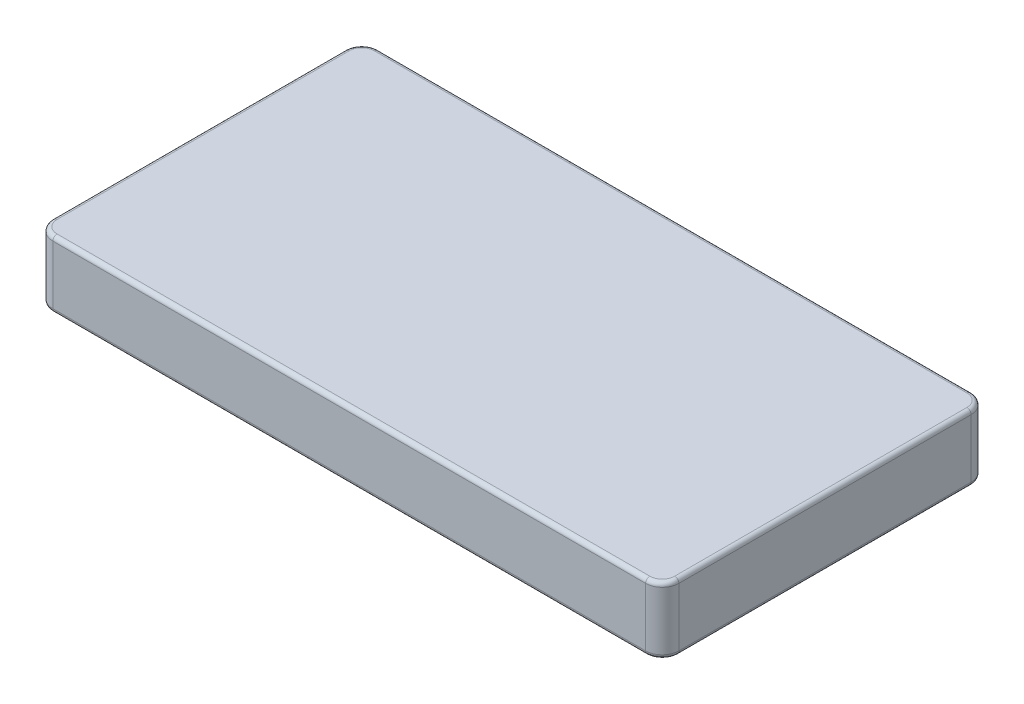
ISO-10303-21;
HEADER;
FILE_DESCRIPTION(('STEP AP214'),'2;1');
FILE_NAME('part.step','',(''),(''),'','','');
FILE_SCHEMA(('AUTOMOTIVE_DESIGN { 1 0 10303 214 1 1 1 1 }'));
ENDSEC;
DATA;
#1=APPLICATION_CONTEXT('core data for automotive mechanical design processes');
#2=APPLICATION_PROTOCOL_DEFINITION('international standard','automotive_design',2000,#1);
#3=PRODUCT_CONTEXT('',#1,'mechanical');
#4=PRODUCT('Part','Part','',(#3));
#5=PRODUCT_RELATED_PRODUCT_CATEGORY('part','',(#4));
#6=PRODUCT_DEFINITION_FORMATION('','',#4);
#7=PRODUCT_DEFINITION_CONTEXT('part definition',#1,'design');
#8=PRODUCT_DEFINITION('design','',#6,#7);
#9=PRODUCT_DEFINITION_SHAPE('','',#8);
#10=(LENGTH_UNIT() NAMED_UNIT(*) SI_UNIT(.MILLI.,.METRE.));
#11=(NAMED_UNIT(*) PLANE_ANGLE_UNIT() SI_UNIT($,.RADIAN.));
#12=(NAMED_UNIT(*) SI_UNIT($,.STERADIAN.) SOLID_ANGLE_UNIT());
#13=UNCERTAINTY_MEASURE_WITH_UNIT(LENGTH_MEASURE(1.E-05),#10,'distance_accuracy_value','');
#14=(GEOMETRIC_REPRESENTATION_CONTEXT(3) GLOBAL_UNCERTAINTY_ASSIGNED_CONTEXT((#13)) GLOBAL_UNIT_ASSIGNED_CONTEXT((#10,
#11,#12)) REPRESENTATION_CONTEXT('',''));
#15=CARTESIAN_POINT('',(0.,0.,0.));
#16=DIRECTION('',(0.,0.,1.));
#17=DIRECTION('',(1.,0.,0.));
#18=AXIS2_PLACEMENT_3D('',#15,#16,#17);
#19=CARTESIAN_POINT('',(901.7,203.2,-444.5));
#20=DIRECTION('',(0.,-1.,0.));
#21=DIRECTION('',(0.,0.,-1.));
#22=AXIS2_PLACEMENT_3D('',#19,#20,#21);
#23=CYLINDRICAL_SURFACE('',#22,50.8);
#24=DIRECTION('',(0.,-1.,0.));
#25=VECTOR('',#24,1.);
#26=CARTESIAN_POINT('',(952.5,203.2,-444.5));
#27=LINE('',#26,#25);
#28=CARTESIAN_POINT('',(952.5,190.5,-444.5));
#29=VERTEX_POINT('',#28);
#30=CARTESIAN_POINT('',(952.5,12.7,-444.5));
#31=VERTEX_POINT('',#30);
#32=EDGE_CURVE('E154',#29,#31,#27,.T.);
#33=ORIENTED_EDGE('',*,*,#32,.T.);
#34=CARTESIAN_POINT('',(901.7,12.7,-444.5));
#35=DIRECTION('',(0.,-1.,0.));
#36=DIRECTION('',(0.,0.,-1.));
#37=AXIS2_PLACEMENT_3D('',#34,#35,#36);
#38=CIRCLE('',#37,50.8);
#39=CARTESIAN_POINT('',(901.699999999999,12.7,-495.3));
#40=VERTEX_POINT('',#39);
#41=EDGE_CURVE('E277',#31,#40,#38,.F.);
#42=ORIENTED_EDGE('',*,*,#41,.T.);
#43=DIRECTION('',(0.,-1.,0.));
#44=VECTOR('',#43,1.);
#45=CARTESIAN_POINT('',(901.699999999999,203.2,-495.3));
#46=LINE('',#45,#44);
#47=CARTESIAN_POINT('',(901.699999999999,190.5,-495.3));
#48=VERTEX_POINT('',#47);
#49=EDGE_CURVE('E176',#48,#40,#46,.T.);
#50=ORIENTED_EDGE('',*,*,#49,.F.);
#51=CARTESIAN_POINT('',(901.7,190.5,-444.5));
#52=DIRECTION('',(0.,-1.,0.));
#53=DIRECTION('',(0.,0.,-1.));
#54=AXIS2_PLACEMENT_3D('',#51,#52,#53);
#55=CIRCLE('',#54,50.8);
#56=EDGE_CURVE('E275',#48,#29,#55,.T.);
#57=ORIENTED_EDGE('',*,*,#56,.T.);
#58=EDGE_LOOP('',(#33,#42,#50,#57));
#59=FACE_BOUND('',#58,.T.);
#60=ADVANCED_FACE('F33',(#59),#23,.T.);
#61=CARTESIAN_POINT('',(-901.7,203.2,-495.3));
#62=DIRECTION('',(0.,0.,1.));
#63=DIRECTION('',(1.,0.,0.));
#64=AXIS2_PLACEMENT_3D('',#61,#62,#63);
#65=PLANE('',#64);
#66=ORIENTED_EDGE('',*,*,#49,.T.);
#67=DIRECTION('',(-1.,0.,0.));
#68=VECTOR('',#67,1.);
#69=CARTESIAN_POINT('',(-901.7,12.7,-495.3));
#70=LINE('',#69,#68);
#71=CARTESIAN_POINT('',(-901.7,12.7,-495.3));
#72=VERTEX_POINT('',#71);
#73=EDGE_CURVE('E281',#40,#72,#70,.T.);
#74=ORIENTED_EDGE('',*,*,#73,.T.);
#75=DIRECTION('',(0.,-1.,0.));
#76=VECTOR('',#75,1.);
#77=CARTESIAN_POINT('',(-901.7,203.2,-495.3));
#78=LINE('',#77,#76);
#79=CARTESIAN_POINT('',(-901.7,190.5,-495.3));
#80=VERTEX_POINT('',#79);
#81=EDGE_CURVE('E252',#80,#72,#78,.T.);
#82=ORIENTED_EDGE('',*,*,#81,.F.);
#83=DIRECTION('',(-1.,0.,0.));
#84=VECTOR('',#83,1.);
#85=CARTESIAN_POINT('',(-901.7,190.5,-495.3));
#86=LINE('',#85,#84);
#87=EDGE_CURVE('E279',#80,#48,#86,.F.);
#88=ORIENTED_EDGE('',*,*,#87,.T.);
#89=EDGE_LOOP('',(#66,#74,#82,#88));
#90=FACE_BOUND('',#89,.T.);
#91=ADVANCED_FACE('F319',(#90),#65,.F.);
#92=CARTESIAN_POINT('',(-901.7,203.2,-444.5));
#93=DIRECTION('',(0.,-1.,0.));
#94=DIRECTION('',(0.,0.,-1.));
#95=AXIS2_PLACEMENT_3D('',#92,#93,#94);
#96=CYLINDRICAL_SURFACE('',#95,50.8);
#97=ORIENTED_EDGE('',*,*,#81,.T.);
#98=CARTESIAN_POINT('',(-901.7,12.7,-444.5));
#99=DIRECTION('',(0.,-1.,0.));
#100=DIRECTION('',(0.,0.,-1.));
#101=AXIS2_PLACEMENT_3D('',#98,#99,#100);
#102=CIRCLE('',#101,50.8);
#103=CARTESIAN_POINT('',(-952.5,12.7,-444.5));
#104=VERTEX_POINT('',#103);
#105=EDGE_CURVE('E285',#72,#104,#102,.F.);
#106=ORIENTED_EDGE('',*,*,#105,.T.);
#107=DIRECTION('',(0.,-1.,0.));
#108=VECTOR('',#107,1.);
#109=CARTESIAN_POINT('',(-952.5,203.2,-444.5));
#110=LINE('',#109,#108);
#111=CARTESIAN_POINT('',(-952.5,190.5,-444.5));
#112=VERTEX_POINT('',#111);
#113=EDGE_CURVE('E249',#112,#104,#110,.T.);
#114=ORIENTED_EDGE('',*,*,#113,.F.);
#115=CARTESIAN_POINT('',(-901.7,190.5,-444.5));
#116=DIRECTION('',(0.,-1.,0.));
#117=DIRECTION('',(0.,0.,-1.));
#118=AXIS2_PLACEMENT_3D('',#115,#116,#117);
#119=CIRCLE('',#118,50.8);
#120=EDGE_CURVE('E283',#112,#80,#119,.T.);
#121=ORIENTED_EDGE('',*,*,#120,.T.);
#122=EDGE_LOOP('',(#97,#106,#114,#121));
#123=FACE_BOUND('',#122,.T.);
#124=ADVANCED_FACE('F336',(#123),#96,.T.);
#125=CARTESIAN_POINT('',(-952.5,203.2,444.5));
#126=DIRECTION('',(1.,0.,0.));
#127=DIRECTION('',(0.,0.,-1.));
#128=AXIS2_PLACEMENT_3D('',#125,#126,#127);
#129=PLANE('',#128);
#130=ORIENTED_EDGE('',*,*,#113,.T.);
#131=DIRECTION('',(0.,0.,1.));
#132=VECTOR('',#131,1.);
#133=CARTESIAN_POINT('',(-952.5,12.7,444.5));
#134=LINE('',#133,#132);
#135=CARTESIAN_POINT('',(-952.5,12.7,444.5));
#136=VERTEX_POINT('',#135);
#137=EDGE_CURVE('E289',#104,#136,#134,.T.);
#138=ORIENTED_EDGE('',*,*,#137,.T.);
#139=DIRECTION('',(0.,-1.,0.));
#140=VECTOR('',#139,1.);
#141=CARTESIAN_POINT('',(-952.5,203.2,444.5));
#142=LINE('',#141,#140);
#143=CARTESIAN_POINT('',(-952.5,190.5,444.5));
#144=VERTEX_POINT('',#143);
#145=EDGE_CURVE('E246',#144,#136,#142,.T.);
#146=ORIENTED_EDGE('',*,*,#145,.F.);
#147=DIRECTION('',(0.,0.,1.));
#148=VECTOR('',#147,1.);
#149=CARTESIAN_POINT('',(-952.5,190.5,444.5));
#150=LINE('',#149,#148);
#151=EDGE_CURVE('E287',#144,#112,#150,.F.);
#152=ORIENTED_EDGE('',*,*,#151,.T.);
#153=EDGE_LOOP('',(#130,#138,#146,#152));
#154=FACE_BOUND('',#153,.T.);
#155=ADVANCED_FACE('F339',(#154),#129,.F.);
#156=CARTESIAN_POINT('',(-901.7,203.2,444.5));
#157=DIRECTION('',(0.,-1.,0.));
#158=DIRECTION('',(0.,0.,-1.));
#159=AXIS2_PLACEMENT_3D('',#156,#157,#158);
#160=CYLINDRICAL_SURFACE('',#159,50.8);
#161=ORIENTED_EDGE('',*,*,#145,.T.);
#162=CARTESIAN_POINT('',(-901.7,12.7,444.5));
#163=DIRECTION('',(0.,-1.,0.));
#164=DIRECTION('',(0.,0.,-1.));
#165=AXIS2_PLACEMENT_3D('',#162,#163,#164);
#166=CIRCLE('',#165,50.8);
#167=CARTESIAN_POINT('',(-901.7,12.7,495.3));
#168=VERTEX_POINT('',#167);
#169=EDGE_CURVE('E293',#136,#168,#166,.F.);
#170=ORIENTED_EDGE('',*,*,#169,.T.);
#171=DIRECTION('',(0.,-1.,0.));
#172=VECTOR('',#171,1.);
#173=CARTESIAN_POINT('',(-901.7,203.2,495.3));
#174=LINE('',#173,#172);
#175=CARTESIAN_POINT('',(-901.7,190.5,495.3));
#176=VERTEX_POINT('',#175);
#177=EDGE_CURVE('E243',#176,#168,#174,.T.);
#178=ORIENTED_EDGE('',*,*,#177,.F.);
#179=CARTESIAN_POINT('',(-901.7,190.5,444.5));
#180=DIRECTION('',(0.,-1.,0.));
#181=DIRECTION('',(0.,0.,-1.));
#182=AXIS2_PLACEMENT_3D('',#179,#180,#181);
#183=CIRCLE('',#182,50.8);
#184=EDGE_CURVE('E291',#176,#144,#183,.T.);
#185=ORIENTED_EDGE('',*,*,#184,.T.);
#186=EDGE_LOOP('',(#161,#170,#178,#185));
#187=FACE_BOUND('',#186,.T.);
#188=ADVANCED_FACE('F520',(#187),#160,.T.);
#189=CARTESIAN_POINT('',(-901.7,203.2,495.3));
#190=DIRECTION('',(0.,0.,-1.));
#191=DIRECTION('',(-1.,0.,0.));
#192=AXIS2_PLACEMENT_3D('',#189,#190,#191);
#193=PLANE('',#192);
#194=ORIENTED_EDGE('',*,*,#177,.T.);
#195=DIRECTION('',(1.,0.,0.));
#196=VECTOR('',#195,1.);
#197=CARTESIAN_POINT('',(901.699999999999,12.7,495.3));
#198=LINE('',#197,#196);
#199=CARTESIAN_POINT('',(901.699999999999,12.7,495.3));
#200=VERTEX_POINT('',#199);
#201=EDGE_CURVE('E297',#168,#200,#198,.T.);
#202=ORIENTED_EDGE('',*,*,#201,.T.);
#203=DIRECTION('',(0.,-1.,0.));
#204=VECTOR('',#203,1.);
#205=CARTESIAN_POINT('',(901.699999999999,203.2,495.3));
#206=LINE('',#205,#204);
#207=CARTESIAN_POINT('',(901.699999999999,190.5,495.3));
#208=VERTEX_POINT('',#207);
#209=EDGE_CURVE('E170',#208,#200,#206,.T.);
#210=ORIENTED_EDGE('',*,*,#209,.F.);
#211=DIRECTION('',(1.,0.,0.));
#212=VECTOR('',#211,1.);
#213=CARTESIAN_POINT('',(-901.7,190.5,495.3));
#214=LINE('',#213,#212);
#215=EDGE_CURVE('E295',#208,#176,#214,.F.);
#216=ORIENTED_EDGE('',*,*,#215,.T.);
#217=EDGE_LOOP('',(#194,#202,#210,#216));
#218=FACE_BOUND('',#217,.T.);
#219=ADVANCED_FACE('F512',(#218),#193,.F.);
#220=CARTESIAN_POINT('',(901.7,203.2,444.5));
#221=DIRECTION('',(0.,-1.,0.));
#222=DIRECTION('',(0.,0.,-1.));
#223=AXIS2_PLACEMENT_3D('',#220,#221,#222);
#224=CYLINDRICAL_SURFACE('',#223,50.8);
#225=ORIENTED_EDGE('',*,*,#209,.T.);
#226=CARTESIAN_POINT('',(901.7,12.7,444.5));
#227=DIRECTION('',(0.,-1.,0.));
#228=DIRECTION('',(0.,0.,-1.));
#229=AXIS2_PLACEMENT_3D('',#226,#227,#228);
#230=CIRCLE('',#229,50.8);
#231=CARTESIAN_POINT('',(952.5,12.7,444.5));
#232=VERTEX_POINT('',#231);
#233=EDGE_CURVE('E169',#200,#232,#230,.F.);
#234=ORIENTED_EDGE('',*,*,#233,.T.);
#235=DIRECTION('',(0.,-1.,0.));
#236=VECTOR('',#235,1.);
#237=CARTESIAN_POINT('',(952.5,203.2,444.5));
#238=LINE('',#237,#236);
#239=CARTESIAN_POINT('',(952.5,190.5,444.5));
#240=VERTEX_POINT('',#239);
#241=EDGE_CURVE('E152',#240,#232,#238,.T.);
#242=ORIENTED_EDGE('',*,*,#241,.F.);
#243=CARTESIAN_POINT('',(901.7,190.5,444.5));
#244=DIRECTION('',(0.,-1.,0.));
#245=DIRECTION('',(0.,0.,-1.));
#246=AXIS2_PLACEMENT_3D('',#243,#244,#245);
#247=CIRCLE('',#246,50.8);
#248=EDGE_CURVE('E166',#240,#208,#247,.T.);
#249=ORIENTED_EDGE('',*,*,#248,.T.);
#250=EDGE_LOOP('',(#225,#234,#242,#249));
#251=FACE_BOUND('',#250,.T.);
#252=ADVANCED_FACE('F165',(#251),#224,.T.);
#253=CARTESIAN_POINT('',(952.5,203.2,444.5));
#254=DIRECTION('',(-1.,0.,0.));
#255=DIRECTION('',(0.,0.,1.));
#256=AXIS2_PLACEMENT_3D('',#253,#254,#255);
#257=PLANE('',#256);
#258=ORIENTED_EDGE('',*,*,#241,.T.);
#259=DIRECTION('',(0.,0.,-1.));
#260=VECTOR('',#259,1.);
#261=CARTESIAN_POINT('',(952.5,12.7,-444.5));
#262=LINE('',#261,#260);
#263=EDGE_CURVE('E158',#232,#31,#262,.T.);
#264=ORIENTED_EDGE('',*,*,#263,.T.);
#265=ORIENTED_EDGE('',*,*,#32,.F.);
#266=DIRECTION('',(0.,0.,-1.));
#267=VECTOR('',#266,1.);
#268=CARTESIAN_POINT('',(952.5,190.5,444.5));
#269=LINE('',#268,#267);
#270=EDGE_CURVE('E149',#29,#240,#269,.F.);
#271=ORIENTED_EDGE('',*,*,#270,.T.);
#272=EDGE_LOOP('',(#258,#264,#265,#271));
#273=FACE_BOUND('',#272,.T.);
#274=ADVANCED_FACE('F151',(#273),#257,.F.);
#275=CARTESIAN_POINT('',(901.7,203.2,-444.5));
#276=DIRECTION('',(0.,-1.,0.));
#277=DIRECTION('',(0.,0.,-1.));
#278=AXIS2_PLACEMENT_3D('',#275,#276,#277);
#279=PLANE('',#278);
#280=DIRECTION('',(1.,0.,0.));
#281=VECTOR('',#280,1.);
#282=CARTESIAN_POINT('',(901.7,203.2,482.6));
#283=LINE('',#282,#281);
#284=CARTESIAN_POINT('',(-901.7,203.2,482.6));
#285=VERTEX_POINT('',#284);
#286=CARTESIAN_POINT('',(901.7,203.2,482.6));
#287=VERTEX_POINT('',#286);
#288=EDGE_CURVE('E299',#285,#287,#283,.T.);
#289=ORIENTED_EDGE('',*,*,#288,.T.);
#290=CARTESIAN_POINT('',(901.7,203.2,444.5));
#291=DIRECTION('',(0.,-1.,0.));
#292=DIRECTION('',(0.,0.,-1.));
#293=AXIS2_PLACEMENT_3D('',#290,#291,#292);
#294=CIRCLE('',#293,38.1);
#295=CARTESIAN_POINT('',(939.8,203.2,444.5));
#296=VERTEX_POINT('',#295);
#297=EDGE_CURVE('E11',#287,#296,#294,.F.);
#298=ORIENTED_EDGE('',*,*,#297,.T.);
#299=DIRECTION('',(0.,0.,-1.));
#300=VECTOR('',#299,1.);
#301=CARTESIAN_POINT('',(939.8,203.2,-444.5));
#302=LINE('',#301,#300);
#303=CARTESIAN_POINT('',(939.8,203.2,-444.5));
#304=VERTEX_POINT('',#303);
#305=EDGE_CURVE('E42',#296,#304,#302,.T.);
#306=ORIENTED_EDGE('',*,*,#305,.T.);
#307=CARTESIAN_POINT('',(901.7,203.2,-444.5));
#308=DIRECTION('',(0.,-1.,0.));
#309=DIRECTION('',(0.,0.,-1.));
#310=AXIS2_PLACEMENT_3D('',#307,#308,#309);
#311=CIRCLE('',#310,38.1);
#312=CARTESIAN_POINT('',(901.7,203.2,-482.6));
#313=VERTEX_POINT('',#312);
#314=EDGE_CURVE('E309',#304,#313,#311,.F.);
#315=ORIENTED_EDGE('',*,*,#314,.T.);
#316=DIRECTION('',(-1.,0.,0.));
#317=VECTOR('',#316,1.);
#318=CARTESIAN_POINT('',(901.7,203.2,-482.6));
#319=LINE('',#318,#317);
#320=CARTESIAN_POINT('',(-901.7,203.2,-482.6));
#321=VERTEX_POINT('',#320);
#322=EDGE_CURVE('E307',#313,#321,#319,.T.);
#323=ORIENTED_EDGE('',*,*,#322,.T.);
#324=CARTESIAN_POINT('',(-901.7,203.2,-444.5));
#325=DIRECTION('',(0.,-1.,0.));
#326=DIRECTION('',(0.,0.,-1.));
#327=AXIS2_PLACEMENT_3D('',#324,#325,#326);
#328=CIRCLE('',#327,38.1);
#329=CARTESIAN_POINT('',(-939.8,203.2,-444.5));
#330=VERTEX_POINT('',#329);
#331=EDGE_CURVE('E305',#321,#330,#328,.F.);
#332=ORIENTED_EDGE('',*,*,#331,.T.);
#333=DIRECTION('',(0.,0.,1.));
#334=VECTOR('',#333,1.);
#335=CARTESIAN_POINT('',(-939.8,203.2,-444.5));
#336=LINE('',#335,#334);
#337=CARTESIAN_POINT('',(-939.8,203.2,444.5));
#338=VERTEX_POINT('',#337);
#339=EDGE_CURVE('E303',#330,#338,#336,.T.);
#340=ORIENTED_EDGE('',*,*,#339,.T.);
#341=CARTESIAN_POINT('',(-901.7,203.2,444.5));
#342=DIRECTION('',(0.,-1.,0.));
#343=DIRECTION('',(0.,0.,-1.));
#344=AXIS2_PLACEMENT_3D('',#341,#342,#343);
#345=CIRCLE('',#344,38.1);
#346=EDGE_CURVE('E301',#338,#285,#345,.F.);
#347=ORIENTED_EDGE('',*,*,#346,.T.);
#348=EDGE_LOOP('',(#289,#298,#306,#315,#323,#332,#340,#347));
#349=FACE_BOUND('',#348,.T.);
#350=ADVANCED_FACE('F310',(#349),#279,.F.);
#351=CARTESIAN_POINT('',(901.7,0.,-444.5));
#352=DIRECTION('',(0.,-1.,0.));
#353=DIRECTION('',(0.,0.,-1.));
#354=AXIS2_PLACEMENT_3D('',#351,#352,#353);
#355=PLANE('',#354);
#356=DIRECTION('',(0.,0.,-1.));
#357=VECTOR('',#356,1.);
#358=CARTESIAN_POINT('',(939.8,0.,444.5));
#359=LINE('',#358,#357);
#360=CARTESIAN_POINT('',(939.8,0.,-444.5));
#361=VERTEX_POINT('',#360);
#362=CARTESIAN_POINT('',(939.8,0.,444.5));
#363=VERTEX_POINT('',#362);
#364=EDGE_CURVE('E270',#361,#363,#359,.F.);
#365=ORIENTED_EDGE('',*,*,#364,.T.);
#366=CARTESIAN_POINT('',(901.7,0.,444.5));
#367=DIRECTION('',(0.,-1.,0.));
#368=DIRECTION('',(0.,0.,-1.));
#369=AXIS2_PLACEMENT_3D('',#366,#367,#368);
#370=CIRCLE('',#369,38.1);
#371=CARTESIAN_POINT('',(901.7,0.,482.6));
#372=VERTEX_POINT('',#371);
#373=EDGE_CURVE('E159',#363,#372,#370,.T.);
#374=ORIENTED_EDGE('',*,*,#373,.T.);
#375=DIRECTION('',(1.,0.,0.));
#376=VECTOR('',#375,1.);
#377=CARTESIAN_POINT('',(-901.7,0.,482.6));
#378=LINE('',#377,#376);
#379=CARTESIAN_POINT('',(-901.7,0.,482.6));
#380=VERTEX_POINT('',#379);
#381=EDGE_CURVE('E258',#372,#380,#378,.F.);
#382=ORIENTED_EDGE('',*,*,#381,.T.);
#383=CARTESIAN_POINT('',(-901.7,0.,444.5));
#384=DIRECTION('',(0.,-1.,0.));
#385=DIRECTION('',(0.,0.,-1.));
#386=AXIS2_PLACEMENT_3D('',#383,#384,#385);
#387=CIRCLE('',#386,38.1);
#388=CARTESIAN_POINT('',(-939.8,0.,444.5));
#389=VERTEX_POINT('',#388);
#390=EDGE_CURVE('E260',#380,#389,#387,.T.);
#391=ORIENTED_EDGE('',*,*,#390,.T.);
#392=DIRECTION('',(0.,0.,1.));
#393=VECTOR('',#392,1.);
#394=CARTESIAN_POINT('',(-939.8,0.,-444.5));
#395=LINE('',#394,#393);
#396=CARTESIAN_POINT('',(-939.8,0.,-444.5));
#397=VERTEX_POINT('',#396);
#398=EDGE_CURVE('E262',#389,#397,#395,.F.);
#399=ORIENTED_EDGE('',*,*,#398,.T.);
#400=CARTESIAN_POINT('',(-901.7,0.,-444.5));
#401=DIRECTION('',(0.,-1.,0.));
#402=DIRECTION('',(0.,0.,-1.));
#403=AXIS2_PLACEMENT_3D('',#400,#401,#402);
#404=CIRCLE('',#403,38.1);
#405=CARTESIAN_POINT('',(-901.7,0.,-482.6));
#406=VERTEX_POINT('',#405);
#407=EDGE_CURVE('E264',#397,#406,#404,.T.);
#408=ORIENTED_EDGE('',*,*,#407,.T.);
#409=DIRECTION('',(-1.,0.,0.));
#410=VECTOR('',#409,1.);
#411=CARTESIAN_POINT('',(901.699999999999,0.,-482.6));
#412=LINE('',#411,#410);
#413=CARTESIAN_POINT('',(901.7,0.,-482.6));
#414=VERTEX_POINT('',#413);
#415=EDGE_CURVE('E266',#406,#414,#412,.F.);
#416=ORIENTED_EDGE('',*,*,#415,.T.);
#417=CARTESIAN_POINT('',(901.7,0.,-444.5));
#418=DIRECTION('',(0.,-1.,0.));
#419=DIRECTION('',(0.,0.,-1.));
#420=AXIS2_PLACEMENT_3D('',#417,#418,#419);
#421=CIRCLE('',#420,38.1);
#422=EDGE_CURVE('E268',#414,#361,#421,.T.);
#423=ORIENTED_EDGE('',*,*,#422,.T.);
#424=EDGE_LOOP('',(#365,#374,#382,#391,#399,#408,#416,#423));
#425=FACE_BOUND('',#424,.T.);
#426=ADVANCED_FACE('F329',(#425),#355,.T.);
#427=CARTESIAN_POINT('',(-901.7,12.7,-444.5));
#428=DIRECTION('',(0.,-1.,0.));
#429=DIRECTION('',(0.,0.,-1.));
#430=AXIS2_PLACEMENT_3D('',#427,#428,#429);
#431=TOROIDAL_SURFACE('',#430,38.1,12.7);
#432=CARTESIAN_POINT('',(-901.7,12.7,-482.6));
#433=DIRECTION('',(1.,0.,0.));
#434=DIRECTION('',(0.,0.,-1.));
#435=AXIS2_PLACEMENT_3D('',#432,#433,#434);
#436=CIRCLE('',#435,12.7);
#437=EDGE_CURVE('E227',#406,#72,#436,.T.);
#438=ORIENTED_EDGE('',*,*,#437,.F.);
#439=ORIENTED_EDGE('',*,*,#407,.F.);
#440=CARTESIAN_POINT('',(-939.8,12.7,-444.5));
#441=DIRECTION('',(0.,0.,1.));
#442=DIRECTION('',(1.,0.,0.));
#443=AXIS2_PLACEMENT_3D('',#440,#441,#442);
#444=CIRCLE('',#443,12.7);
#445=EDGE_CURVE('E183',#104,#397,#444,.T.);
#446=ORIENTED_EDGE('',*,*,#445,.F.);
#447=ORIENTED_EDGE('',*,*,#105,.F.);
#448=EDGE_LOOP('',(#438,#439,#446,#447));
#449=FACE_BOUND('',#448,.T.);
#450=ADVANCED_FACE('F333',(#449),#431,.T.);
#451=CARTESIAN_POINT('',(-939.8,12.7,444.5));
#452=DIRECTION('',(0.,0.,-1.));
#453=DIRECTION('',(-1.,0.,0.));
#454=AXIS2_PLACEMENT_3D('',#451,#452,#453);
#455=CYLINDRICAL_SURFACE('',#454,12.7);
#456=ORIENTED_EDGE('',*,*,#445,.T.);
#457=ORIENTED_EDGE('',*,*,#398,.F.);
#458=CARTESIAN_POINT('',(-939.8,12.7,444.5));
#459=DIRECTION('',(0.,0.,1.));
#460=DIRECTION('',(1.,0.,0.));
#461=AXIS2_PLACEMENT_3D('',#458,#459,#460);
#462=CIRCLE('',#461,12.7);
#463=EDGE_CURVE('E225',#136,#389,#462,.T.);
#464=ORIENTED_EDGE('',*,*,#463,.F.);
#465=ORIENTED_EDGE('',*,*,#137,.F.);
#466=EDGE_LOOP('',(#456,#457,#464,#465));
#467=FACE_BOUND('',#466,.T.);
#468=ADVANCED_FACE('F381',(#467),#455,.T.);
#469=CARTESIAN_POINT('',(-901.7,12.7,-482.6));
#470=DIRECTION('',(1.,0.,0.));
#471=DIRECTION('',(0.,0.,-1.));
#472=AXIS2_PLACEMENT_3D('',#469,#470,#471);
#473=CYLINDRICAL_SURFACE('',#472,12.7);
#474=ORIENTED_EDGE('',*,*,#437,.T.);
#475=ORIENTED_EDGE('',*,*,#73,.F.);
#476=CARTESIAN_POINT('',(901.7,12.7,-482.6));
#477=DIRECTION('',(1.,0.,0.));
#478=DIRECTION('',(0.,0.,-1.));
#479=AXIS2_PLACEMENT_3D('',#476,#477,#478);
#480=CIRCLE('',#479,12.7);
#481=EDGE_CURVE('E222',#414,#40,#480,.T.);
#482=ORIENTED_EDGE('',*,*,#481,.F.);
#483=ORIENTED_EDGE('',*,*,#415,.F.);
#484=EDGE_LOOP('',(#474,#475,#482,#483));
#485=FACE_BOUND('',#484,.T.);
#486=ADVANCED_FACE('F322',(#485),#473,.T.);
#487=CARTESIAN_POINT('',(-901.7,12.7,444.5));
#488=DIRECTION('',(0.,-1.,0.));
#489=DIRECTION('',(0.,0.,-1.));
#490=AXIS2_PLACEMENT_3D('',#487,#488,#489);
#491=TOROIDAL_SURFACE('',#490,38.1,12.7);
#492=ORIENTED_EDGE('',*,*,#463,.T.);
#493=ORIENTED_EDGE('',*,*,#390,.F.);
#494=CARTESIAN_POINT('',(-901.7,12.7,482.6));
#495=DIRECTION('',(1.,0.,0.));
#496=DIRECTION('',(0.,0.,-1.));
#497=AXIS2_PLACEMENT_3D('',#494,#495,#496);
#498=CIRCLE('',#497,12.7);
#499=EDGE_CURVE('E219',#168,#380,#498,.T.);
#500=ORIENTED_EDGE('',*,*,#499,.F.);
#501=ORIENTED_EDGE('',*,*,#169,.F.);
#502=EDGE_LOOP('',(#492,#493,#500,#501));
#503=FACE_BOUND('',#502,.T.);
#504=ADVANCED_FACE('F375',(#503),#491,.T.);
#505=CARTESIAN_POINT('',(901.7,12.7,-444.5));
#506=DIRECTION('',(0.,-1.,0.));
#507=DIRECTION('',(0.,0.,-1.));
#508=AXIS2_PLACEMENT_3D('',#505,#506,#507);
#509=TOROIDAL_SURFACE('',#508,38.1,12.7);
#510=ORIENTED_EDGE('',*,*,#481,.T.);
#511=ORIENTED_EDGE('',*,*,#41,.F.);
#512=CARTESIAN_POINT('',(939.8,12.7,-444.5));
#513=DIRECTION('',(0.,0.,1.));
#514=DIRECTION('',(1.,0.,0.));
#515=AXIS2_PLACEMENT_3D('',#512,#513,#514);
#516=CIRCLE('',#515,12.7);
#517=EDGE_CURVE('E213',#361,#31,#516,.T.);
#518=ORIENTED_EDGE('',*,*,#517,.F.);
#519=ORIENTED_EDGE('',*,*,#422,.F.);
#520=EDGE_LOOP('',(#510,#511,#518,#519));
#521=FACE_BOUND('',#520,.T.);
#522=ADVANCED_FACE('F325',(#521),#509,.T.);
#523=CARTESIAN_POINT('',(-901.7,12.7,482.6));
#524=DIRECTION('',(-1.,0.,0.));
#525=DIRECTION('',(0.,0.,1.));
#526=AXIS2_PLACEMENT_3D('',#523,#524,#525);
#527=CYLINDRICAL_SURFACE('',#526,12.7);
#528=ORIENTED_EDGE('',*,*,#499,.T.);
#529=ORIENTED_EDGE('',*,*,#381,.F.);
#530=CARTESIAN_POINT('',(901.699999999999,12.7,482.6));
#531=DIRECTION('',(1.,0.,0.));
#532=DIRECTION('',(0.,1.,0.));
#533=AXIS2_PLACEMENT_3D('',#530,#531,#532);
#534=CIRCLE('',#533,12.7);
#535=EDGE_CURVE('E207',#200,#372,#534,.T.);
#536=ORIENTED_EDGE('',*,*,#535,.F.);
#537=ORIENTED_EDGE('',*,*,#201,.F.);
#538=EDGE_LOOP('',(#528,#529,#536,#537));
#539=FACE_BOUND('',#538,.T.);
#540=ADVANCED_FACE('F368',(#539),#527,.T.);
#541=CARTESIAN_POINT('',(939.8,12.7,444.5));
#542=DIRECTION('',(0.,0.,1.));
#543=DIRECTION('',(1.,0.,0.));
#544=AXIS2_PLACEMENT_3D('',#541,#542,#543);
#545=CYLINDRICAL_SURFACE('',#544,12.7);
#546=ORIENTED_EDGE('',*,*,#517,.T.);
#547=ORIENTED_EDGE('',*,*,#263,.F.);
#548=CARTESIAN_POINT('',(939.8,12.7,444.5));
#549=DIRECTION('',(0.,0.,1.));
#550=DIRECTION('',(1.,0.,0.));
#551=AXIS2_PLACEMENT_3D('',#548,#549,#550);
#552=CIRCLE('',#551,12.7);
#553=EDGE_CURVE('E202',#363,#232,#552,.T.);
#554=ORIENTED_EDGE('',*,*,#553,.F.);
#555=ORIENTED_EDGE('',*,*,#364,.F.);
#556=EDGE_LOOP('',(#546,#547,#554,#555));
#557=FACE_BOUND('',#556,.T.);
#558=ADVANCED_FACE('F356',(#557),#545,.T.);
#559=CARTESIAN_POINT('',(901.7,12.7,444.5));
#560=DIRECTION('',(0.,-1.,0.));
#561=DIRECTION('',(0.,0.,-1.));
#562=AXIS2_PLACEMENT_3D('',#559,#560,#561);
#563=TOROIDAL_SURFACE('',#562,38.1,12.7);
#564=ORIENTED_EDGE('',*,*,#535,.T.);
#565=ORIENTED_EDGE('',*,*,#373,.F.);
#566=ORIENTED_EDGE('',*,*,#553,.T.);
#567=ORIENTED_EDGE('',*,*,#233,.F.);
#568=EDGE_LOOP('',(#564,#565,#566,#567));
#569=FACE_BOUND('',#568,.T.);
#570=ADVANCED_FACE('F351',(#569),#563,.T.);
#571=CARTESIAN_POINT('',(-901.7,190.5,-444.5));
#572=DIRECTION('',(0.,-1.,0.));
#573=DIRECTION('',(0.,0.,-1.));
#574=AXIS2_PLACEMENT_3D('',#571,#572,#573);
#575=TOROIDAL_SURFACE('',#574,38.1,12.7);
#576=CARTESIAN_POINT('',(-901.7,190.5,-482.6));
#577=DIRECTION('',(1.,0.,0.));
#578=DIRECTION('',(0.,1.,0.));
#579=AXIS2_PLACEMENT_3D('',#576,#577,#578);
#580=CIRCLE('',#579,12.7);
#581=EDGE_CURVE('E195',#80,#321,#580,.T.);
#582=ORIENTED_EDGE('',*,*,#581,.F.);
#583=ORIENTED_EDGE('',*,*,#120,.F.);
#584=CARTESIAN_POINT('',(-939.8,190.5,-444.5));
#585=DIRECTION('',(0.,0.,1.));
#586=DIRECTION('',(1.,0.,0.));
#587=AXIS2_PLACEMENT_3D('',#584,#585,#586);
#588=CIRCLE('',#587,12.7);
#589=EDGE_CURVE('E37',#330,#112,#588,.T.);
#590=ORIENTED_EDGE('',*,*,#589,.F.);
#591=ORIENTED_EDGE('',*,*,#331,.F.);
#592=EDGE_LOOP('',(#582,#583,#590,#591));
#593=FACE_BOUND('',#592,.T.);
#594=ADVANCED_FACE('F35',(#593),#575,.T.);
#595=CARTESIAN_POINT('',(-939.8,190.5,-444.5));
#596=DIRECTION('',(0.,0.,1.));
#597=DIRECTION('',(1.,0.,0.));
#598=AXIS2_PLACEMENT_3D('',#595,#596,#597);
#599=CYLINDRICAL_SURFACE('',#598,12.7);
#600=ORIENTED_EDGE('',*,*,#589,.T.);
#601=ORIENTED_EDGE('',*,*,#151,.F.);
#602=CARTESIAN_POINT('',(-939.8,190.5,444.5));
#603=DIRECTION('',(0.,0.,1.));
#604=DIRECTION('',(1.,0.,0.));
#605=AXIS2_PLACEMENT_3D('',#602,#603,#604);
#606=CIRCLE('',#605,12.7);
#607=EDGE_CURVE('E193',#338,#144,#606,.T.);
#608=ORIENTED_EDGE('',*,*,#607,.F.);
#609=ORIENTED_EDGE('',*,*,#339,.F.);
#610=EDGE_LOOP('',(#600,#601,#608,#609));
#611=FACE_BOUND('',#610,.T.);
#612=ADVANCED_FACE('F342',(#611),#599,.T.);
#613=CARTESIAN_POINT('',(901.7,190.5,-482.6));
#614=DIRECTION('',(-1.,0.,0.));
#615=DIRECTION('',(0.,0.,1.));
#616=AXIS2_PLACEMENT_3D('',#613,#614,#615);
#617=CYLINDRICAL_SURFACE('',#616,12.7);
#618=ORIENTED_EDGE('',*,*,#581,.T.);
#619=ORIENTED_EDGE('',*,*,#322,.F.);
#620=CARTESIAN_POINT('',(901.699999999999,190.5,-482.6));
#621=DIRECTION('',(1.,0.,0.));
#622=DIRECTION('',(0.,1.,0.));
#623=AXIS2_PLACEMENT_3D('',#620,#621,#622);
#624=CIRCLE('',#623,12.7);
#625=EDGE_CURVE('E190',#48,#313,#624,.T.);
#626=ORIENTED_EDGE('',*,*,#625,.F.);
#627=ORIENTED_EDGE('',*,*,#87,.F.);
#628=EDGE_LOOP('',(#618,#619,#626,#627));
#629=FACE_BOUND('',#628,.T.);
#630=ADVANCED_FACE('F314',(#629),#617,.T.);
#631=CARTESIAN_POINT('',(-901.7,190.5,444.5));
#632=DIRECTION('',(0.,-1.,0.));
#633=DIRECTION('',(0.,0.,-1.));
#634=AXIS2_PLACEMENT_3D('',#631,#632,#633);
#635=TOROIDAL_SURFACE('',#634,38.1,12.7);
#636=ORIENTED_EDGE('',*,*,#607,.T.);
#637=ORIENTED_EDGE('',*,*,#184,.F.);
#638=CARTESIAN_POINT('',(-901.7,190.5,482.6));
#639=DIRECTION('',(1.,0.,0.));
#640=DIRECTION('',(0.,0.,-1.));
#641=AXIS2_PLACEMENT_3D('',#638,#639,#640);
#642=CIRCLE('',#641,12.7);
#643=EDGE_CURVE('E187',#285,#176,#642,.T.);
#644=ORIENTED_EDGE('',*,*,#643,.F.);
#645=ORIENTED_EDGE('',*,*,#346,.F.);
#646=EDGE_LOOP('',(#636,#637,#644,#645));
#647=FACE_BOUND('',#646,.T.);
#648=ADVANCED_FACE('F346',(#647),#635,.T.);
#649=CARTESIAN_POINT('',(901.7,190.5,-444.5));
#650=DIRECTION('',(0.,-1.,0.));
#651=DIRECTION('',(0.,0.,-1.));
#652=AXIS2_PLACEMENT_3D('',#649,#650,#651);
#653=TOROIDAL_SURFACE('',#652,38.1,12.7);
#654=ORIENTED_EDGE('',*,*,#625,.T.);
#655=ORIENTED_EDGE('',*,*,#314,.F.);
#656=CARTESIAN_POINT('',(939.8,190.5,-444.5));
#657=DIRECTION('',(0.,0.,1.));
#658=DIRECTION('',(1.,0.,0.));
#659=AXIS2_PLACEMENT_3D('',#656,#657,#658);
#660=CIRCLE('',#659,12.7);
#661=EDGE_CURVE('E180',#29,#304,#660,.T.);
#662=ORIENTED_EDGE('',*,*,#661,.F.);
#663=ORIENTED_EDGE('',*,*,#56,.F.);
#664=EDGE_LOOP('',(#654,#655,#662,#663));
#665=FACE_BOUND('',#664,.T.);
#666=ADVANCED_FACE('F316',(#665),#653,.T.);
#667=CARTESIAN_POINT('',(901.7,190.5,482.6));
#668=DIRECTION('',(1.,0.,0.));
#669=DIRECTION('',(0.,0.,-1.));
#670=AXIS2_PLACEMENT_3D('',#667,#668,#669);
#671=CYLINDRICAL_SURFACE('',#670,12.7);
#672=ORIENTED_EDGE('',*,*,#643,.T.);
#673=ORIENTED_EDGE('',*,*,#215,.F.);
#674=CARTESIAN_POINT('',(901.7,190.5,482.6));
#675=DIRECTION('',(1.,0.,0.));
#676=DIRECTION('',(0.,0.,-1.));
#677=AXIS2_PLACEMENT_3D('',#674,#675,#676);
#678=CIRCLE('',#677,12.7);
#679=EDGE_CURVE('E174',#287,#208,#678,.T.);
#680=ORIENTED_EDGE('',*,*,#679,.F.);
#681=ORIENTED_EDGE('',*,*,#288,.F.);
#682=EDGE_LOOP('',(#672,#673,#680,#681));
#683=FACE_BOUND('',#682,.T.);
#684=ADVANCED_FACE('F390',(#683),#671,.T.);
#685=CARTESIAN_POINT('',(939.8,190.5,-444.5));
#686=DIRECTION('',(0.,0.,-1.));
#687=DIRECTION('',(-1.,0.,0.));
#688=AXIS2_PLACEMENT_3D('',#685,#686,#687);
#689=CYLINDRICAL_SURFACE('',#688,12.7);
#690=ORIENTED_EDGE('',*,*,#661,.T.);
#691=ORIENTED_EDGE('',*,*,#305,.F.);
#692=CARTESIAN_POINT('',(939.8,190.5,444.5));
#693=DIRECTION('',(0.,0.,1.));
#694=DIRECTION('',(0.,-1.,0.));
#695=AXIS2_PLACEMENT_3D('',#692,#693,#694);
#696=CIRCLE('',#695,12.7);
#697=EDGE_CURVE('E50',#240,#296,#696,.T.);
#698=ORIENTED_EDGE('',*,*,#697,.F.);
#699=ORIENTED_EDGE('',*,*,#270,.F.);
#700=EDGE_LOOP('',(#690,#691,#698,#699));
#701=FACE_BOUND('',#700,.T.);
#702=ADVANCED_FACE('F178',(#701),#689,.T.);
#703=CARTESIAN_POINT('',(901.7,190.5,444.5));
#704=DIRECTION('',(0.,-1.,0.));
#705=DIRECTION('',(0.,0.,-1.));
#706=AXIS2_PLACEMENT_3D('',#703,#704,#705);
#707=TOROIDAL_SURFACE('',#706,38.1,12.7);
#708=ORIENTED_EDGE('',*,*,#679,.T.);
#709=ORIENTED_EDGE('',*,*,#248,.F.);
#710=ORIENTED_EDGE('',*,*,#697,.T.);
#711=ORIENTED_EDGE('',*,*,#297,.F.);
#712=EDGE_LOOP('',(#708,#709,#710,#711));
#713=FACE_BOUND('',#712,.T.);
#714=ADVANCED_FACE('F172',(#713),#707,.T.);
#715=CLOSED_SHELL('',(#60,#91,#124,#155,#188,#219,#252,#274,#350,#426,#450,#468,#486,#504,#522,
#540,#558,#570,#594,#612,#630,#648,#666,#684,#702,#714));
#716=MANIFOLD_SOLID_BREP('B2',#715);
#717=ADVANCED_BREP_SHAPE_REPRESENTATION('',(#18,#716),#14);
#718=SHAPE_DEFINITION_REPRESENTATION(#9,#717);
ENDSEC;
END-ISO-10303-21;
